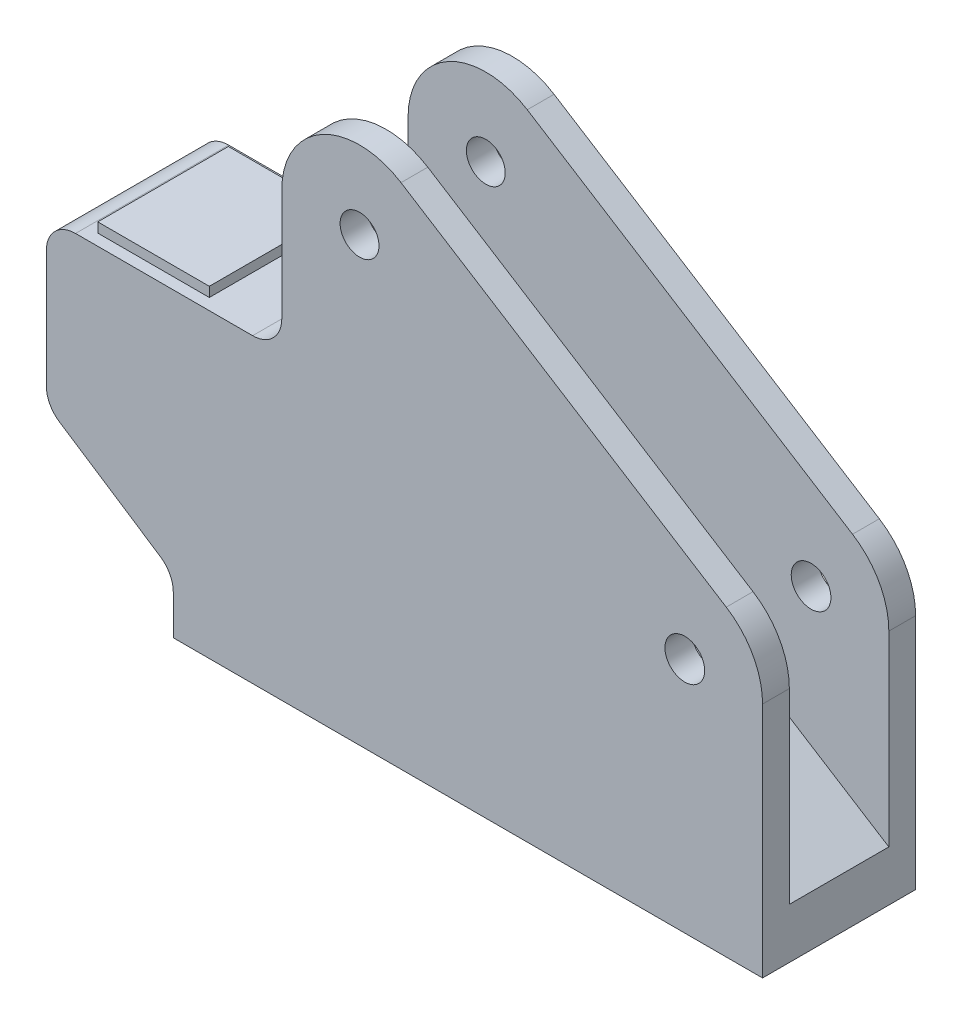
ISO-10303-21;
HEADER;
FILE_DESCRIPTION(('STEP AP214'),'2;1');
FILE_NAME('part.step','',(''),(''),'','','');
FILE_SCHEMA(('AUTOMOTIVE_DESIGN { 1 0 10303 214 1 1 1 1 }'));
ENDSEC;
DATA;
#1=APPLICATION_CONTEXT('core data for automotive mechanical design processes');
#2=APPLICATION_PROTOCOL_DEFINITION('international standard','automotive_design',2000,#1);
#3=PRODUCT_CONTEXT('',#1,'mechanical');
#4=PRODUCT('Part','Part','',(#3));
#5=PRODUCT_RELATED_PRODUCT_CATEGORY('part','',(#4));
#6=PRODUCT_DEFINITION_FORMATION('','',#4);
#7=PRODUCT_DEFINITION_CONTEXT('part definition',#1,'design');
#8=PRODUCT_DEFINITION('design','',#6,#7);
#9=PRODUCT_DEFINITION_SHAPE('','',#8);
#10=(LENGTH_UNIT() NAMED_UNIT(*) SI_UNIT(.MILLI.,.METRE.));
#11=(NAMED_UNIT(*) PLANE_ANGLE_UNIT() SI_UNIT($,.RADIAN.));
#12=(NAMED_UNIT(*) SI_UNIT($,.STERADIAN.) SOLID_ANGLE_UNIT());
#13=UNCERTAINTY_MEASURE_WITH_UNIT(LENGTH_MEASURE(1.E-05),#10,'distance_accuracy_value','');
#14=(GEOMETRIC_REPRESENTATION_CONTEXT(3) GLOBAL_UNCERTAINTY_ASSIGNED_CONTEXT((#13)) GLOBAL_UNIT_ASSIGNED_CONTEXT((#10,
#11,#12)) REPRESENTATION_CONTEXT('',''));
#15=CARTESIAN_POINT('',(0.,0.,0.));
#16=DIRECTION('',(0.,0.,1.));
#17=DIRECTION('',(1.,0.,0.));
#18=AXIS2_PLACEMENT_3D('',#15,#16,#17);
#19=CARTESIAN_POINT('',(207.4,787.4,400.));
#20=DIRECTION('',(0.,-1.,0.));
#21=DIRECTION('',(1.,0.,0.));
#22=AXIS2_PLACEMENT_3D('',#19,#20,#21);
#23=PLANE('',#22);
#24=DIRECTION('',(-1.,0.,0.));
#25=VECTOR('',#24,1.);
#26=CARTESIAN_POINT('',(207.4,787.4,0.));
#27=LINE('',#26,#25);
#28=CARTESIAN_POINT('',(207.4,787.4,0.));
#29=VERTEX_POINT('',#28);
#30=CARTESIAN_POINT('',(-255.38348006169,787.4,0.));
#31=VERTEX_POINT('',#30);
#32=EDGE_CURVE('E325',#29,#31,#27,.T.);
#33=ORIENTED_EDGE('',*,*,#32,.T.);
#34=DIRECTION('',(0.,0.,-1.));
#35=VECTOR('',#34,1.);
#36=CARTESIAN_POINT('',(-255.38348006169,787.4,400.));
#37=LINE('',#36,#35);
#38=CARTESIAN_POINT('',(-255.38348006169,787.4,400.));
#39=VERTEX_POINT('',#38);
#40=EDGE_CURVE('E350',#39,#31,#37,.T.);
#41=ORIENTED_EDGE('',*,*,#40,.F.);
#42=DIRECTION('',(-1.,0.,0.));
#43=VECTOR('',#42,1.);
#44=CARTESIAN_POINT('',(207.4,787.4,400.));
#45=LINE('',#44,#43);
#46=CARTESIAN_POINT('',(207.4,787.4,400.));
#47=VERTEX_POINT('',#46);
#48=EDGE_CURVE('E292',#47,#39,#45,.T.);
#49=ORIENTED_EDGE('',*,*,#48,.F.);
#50=DIRECTION('',(0.,0.,-1.));
#51=VECTOR('',#50,1.);
#52=CARTESIAN_POINT('',(207.4,787.4,400.));
#53=LINE('',#52,#51);
#54=EDGE_CURVE('E353',#47,#29,#53,.T.);
#55=ORIENTED_EDGE('',*,*,#54,.T.);
#56=EDGE_LOOP('',(#33,#41,#49,#55));
#57=FACE_BOUND('',#56,.T.);
#58=DIRECTION('',(0.,0.,1.));
#59=VECTOR('',#58,1.);
#60=CARTESIAN_POINT('',(-227.086377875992,787.4,28.9117784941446));
#61=LINE('',#60,#59);
#62=CARTESIAN_POINT('',(-227.086377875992,787.4,28.9117784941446));
#63=VERTEX_POINT('',#62);
#64=CARTESIAN_POINT('',(-227.086377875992,787.4,370.164244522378));
#65=VERTEX_POINT('',#64);
#66=EDGE_CURVE('E212',#63,#65,#61,.T.);
#67=ORIENTED_EDGE('',*,*,#66,.F.);
#68=DIRECTION('',(-1.,0.,0.));
#69=VECTOR('',#68,1.);
#70=CARTESIAN_POINT('',(-227.086377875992,787.4,28.9117784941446));
#71=LINE('',#70,#69);
#72=CARTESIAN_POINT('',(64.4080050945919,787.4,28.9117784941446));
#73=VERTEX_POINT('',#72);
#74=EDGE_CURVE('E209',#73,#63,#71,.T.);
#75=ORIENTED_EDGE('',*,*,#74,.F.);
#76=DIRECTION('',(0.,0.,-1.));
#77=VECTOR('',#76,1.);
#78=CARTESIAN_POINT('',(64.4080050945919,787.4,28.9117784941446));
#79=LINE('',#78,#77);
#80=CARTESIAN_POINT('',(64.4080050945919,787.4,370.164244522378));
#81=VERTEX_POINT('',#80);
#82=EDGE_CURVE('E52',#81,#73,#79,.T.);
#83=ORIENTED_EDGE('',*,*,#82,.F.);
#84=DIRECTION('',(1.,0.,0.));
#85=VECTOR('',#84,1.);
#86=CARTESIAN_POINT('',(-227.086377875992,787.4,370.164244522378));
#87=LINE('',#86,#85);
#88=EDGE_CURVE('E47',#65,#81,#87,.T.);
#89=ORIENTED_EDGE('',*,*,#88,.F.);
#90=EDGE_LOOP('',(#67,#75,#83,#89));
#91=FACE_BOUND('',#90,.T.);
#92=ADVANCED_FACE('F32',(#57,#91),#23,.F.);
#93=CARTESIAN_POINT('',(1336.8,620.,400.));
#94=DIRECTION('',(0.,0.,-1.));
#95=DIRECTION('',(-1.,0.,0.));
#96=AXIS2_PLACEMENT_3D('',#93,#94,#95);
#97=CYLINDRICAL_SURFACE('',#96,203.2);
#98=DIRECTION('',(0.,0.,-1.));
#99=VECTOR('',#98,1.);
#100=CARTESIAN_POINT('',(1445.14220637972,791.907551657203,400.));
#101=LINE('',#100,#99);
#102=CARTESIAN_POINT('',(1445.14220637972,791.907551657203,70.));
#103=VERTEX_POINT('',#102);
#104=CARTESIAN_POINT('',(1445.14220637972,791.907551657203,0.));
#105=VERTEX_POINT('',#104);
#106=EDGE_CURVE('E367',#103,#105,#101,.T.);
#107=ORIENTED_EDGE('',*,*,#106,.F.);
#108=CARTESIAN_POINT('',(1336.8,620.,70.));
#109=DIRECTION('',(0.,0.,-1.));
#110=DIRECTION('',(-1.,0.,0.));
#111=AXIS2_PLACEMENT_3D('',#108,#109,#110);
#112=CIRCLE('',#111,203.2);
#113=CARTESIAN_POINT('',(1540.,620.,70.));
#114=VERTEX_POINT('',#113);
#115=EDGE_CURVE('E253',#103,#114,#112,.T.);
#116=ORIENTED_EDGE('',*,*,#115,.T.);
#117=DIRECTION('',(0.,0.,-1.));
#118=VECTOR('',#117,1.);
#119=CARTESIAN_POINT('',(1540.,620.,400.));
#120=LINE('',#119,#118);
#121=CARTESIAN_POINT('',(1540.,620.,0.));
#122=VERTEX_POINT('',#121);
#123=EDGE_CURVE('E371',#114,#122,#120,.T.);
#124=ORIENTED_EDGE('',*,*,#123,.T.);
#125=CARTESIAN_POINT('',(1336.8,620.,0.));
#126=DIRECTION('',(0.,0.,1.));
#127=DIRECTION('',(1.,0.,0.));
#128=AXIS2_PLACEMENT_3D('',#125,#126,#127);
#129=CIRCLE('',#128,203.2);
#130=EDGE_CURVE('E312',#122,#105,#129,.T.);
#131=ORIENTED_EDGE('',*,*,#130,.T.);
#132=EDGE_LOOP('',(#107,#116,#124,#131));
#133=FACE_BOUND('',#132,.T.);
#134=ADVANCED_FACE('F411',(#133),#97,.T.);
#135=CARTESIAN_POINT('',(1445.14220637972,791.907551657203,400.));
#136=DIRECTION('',(-0.533180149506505,-0.84600173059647,0.));
#137=DIRECTION('',(0.84600173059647,-0.533180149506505,0.));
#138=AXIS2_PLACEMENT_3D('',#135,#136,#137);
#139=PLANE('',#138);
#140=DIRECTION('',(0.,0.,-1.));
#141=VECTOR('',#140,1.);
#142=CARTESIAN_POINT('',(595.142206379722,1327.6075516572,400.));
#143=LINE('',#142,#141);
#144=CARTESIAN_POINT('',(595.142206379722,1327.6075516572,70.));
#145=VERTEX_POINT('',#144);
#146=CARTESIAN_POINT('',(595.142206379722,1327.6075516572,0.));
#147=VERTEX_POINT('',#146);
#148=EDGE_CURVE('E363',#145,#147,#143,.T.);
#149=ORIENTED_EDGE('',*,*,#148,.F.);
#150=DIRECTION('',(-0.846001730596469,0.533180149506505,0.));
#151=VECTOR('',#150,1.);
#152=CARTESIAN_POINT('',(224.268360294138,1561.34533912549,70.));
#153=LINE('',#152,#151);
#154=EDGE_CURVE('E215',#103,#145,#153,.T.);
#155=ORIENTED_EDGE('',*,*,#154,.F.);
#156=ORIENTED_EDGE('',*,*,#106,.T.);
#157=DIRECTION('',(-0.84600173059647,0.533180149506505,0.));
#158=VECTOR('',#157,1.);
#159=CARTESIAN_POINT('',(1445.14220637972,791.907551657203,0.));
#160=LINE('',#159,#158);
#161=EDGE_CURVE('E315',#105,#147,#160,.T.);
#162=ORIENTED_EDGE('',*,*,#161,.T.);
#163=EDGE_LOOP('',(#149,#155,#156,#162));
#164=FACE_BOUND('',#163,.T.);
#165=ADVANCED_FACE('F417',(#164),#139,.F.);
#166=CARTESIAN_POINT('',(486.8,1155.7,400.));
#167=DIRECTION('',(0.,0.,-1.));
#168=DIRECTION('',(-1.,0.,0.));
#169=AXIS2_PLACEMENT_3D('',#166,#167,#168);
#170=CYLINDRICAL_SURFACE('',#169,203.2);
#171=DIRECTION('',(0.,0.,-1.));
#172=VECTOR('',#171,1.);
#173=CARTESIAN_POINT('',(283.6,1155.7,400.));
#174=LINE('',#173,#172);
#175=CARTESIAN_POINT('',(283.6,1155.7,70.));
#176=VERTEX_POINT('',#175);
#177=CARTESIAN_POINT('',(283.6,1155.7,0.));
#178=VERTEX_POINT('',#177);
#179=EDGE_CURVE('E359',#176,#178,#174,.T.);
#180=ORIENTED_EDGE('',*,*,#179,.F.);
#181=CARTESIAN_POINT('',(486.8,1155.7,70.));
#182=DIRECTION('',(0.,0.,-1.));
#183=DIRECTION('',(-1.,0.,0.));
#184=AXIS2_PLACEMENT_3D('',#181,#182,#183);
#185=CIRCLE('',#184,203.2);
#186=EDGE_CURVE('E250',#176,#145,#185,.T.);
#187=ORIENTED_EDGE('',*,*,#186,.T.);
#188=ORIENTED_EDGE('',*,*,#148,.T.);
#189=CARTESIAN_POINT('',(486.8,1155.7,0.));
#190=DIRECTION('',(0.,0.,1.));
#191=DIRECTION('',(1.,0.,0.));
#192=AXIS2_PLACEMENT_3D('',#189,#190,#191);
#193=CIRCLE('',#192,203.2);
#194=EDGE_CURVE('E318',#147,#178,#193,.T.);
#195=ORIENTED_EDGE('',*,*,#194,.T.);
#196=EDGE_LOOP('',(#180,#187,#188,#195));
#197=FACE_BOUND('',#196,.T.);
#198=ADVANCED_FACE('F438',(#197),#170,.T.);
#199=CARTESIAN_POINT('',(486.8,1155.7,400.));
#200=DIRECTION('',(0.,0.,-1.));
#201=DIRECTION('',(-1.,0.,0.));
#202=AXIS2_PLACEMENT_3D('',#199,#200,#201);
#203=CYLINDRICAL_SURFACE('',#202,50.7999999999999);
#204=CARTESIAN_POINT('',(486.8,1155.7,70.));
#205=DIRECTION('',(0.,0.,-1.));
#206=DIRECTION('',(-1.,0.,0.));
#207=AXIS2_PLACEMENT_3D('',#204,#205,#206);
#208=CIRCLE('',#207,50.7999999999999);
#209=CARTESIAN_POINT('',(436.,1155.7,70.));
#210=VERTEX_POINT('',#209);
#211=EDGE_CURVE('E244',#210,#210,#208,.T.);
#212=ORIENTED_EDGE('',*,*,#211,.F.);
#213=EDGE_LOOP('',(#212));
#214=FACE_BOUND('',#213,.T.);
#215=CARTESIAN_POINT('',(486.8,1155.7,0.));
#216=DIRECTION('',(0.,0.,1.));
#217=DIRECTION('',(1.,0.,0.));
#218=AXIS2_PLACEMENT_3D('',#215,#216,#217);
#219=CIRCLE('',#218,50.7999999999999);
#220=CARTESIAN_POINT('',(537.6,1155.7,0.));
#221=VERTEX_POINT('',#220);
#222=EDGE_CURVE('E265',#221,#221,#219,.T.);
#223=ORIENTED_EDGE('',*,*,#222,.F.);
#224=EDGE_LOOP('',(#223));
#225=FACE_BOUND('',#224,.T.);
#226=ADVANCED_FACE('F391',(#214,#225),#203,.F.);
#227=CARTESIAN_POINT('',(1336.8,620.,400.));
#228=DIRECTION('',(0.,0.,-1.));
#229=DIRECTION('',(-1.,0.,0.));
#230=AXIS2_PLACEMENT_3D('',#227,#228,#229);
#231=CYLINDRICAL_SURFACE('',#230,51.9020150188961);
#232=CARTESIAN_POINT('',(1336.8,620.,70.));
#233=DIRECTION('',(0.,0.,-1.));
#234=DIRECTION('',(-1.,0.,0.));
#235=AXIS2_PLACEMENT_3D('',#232,#233,#234);
#236=CIRCLE('',#235,51.9020150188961);
#237=CARTESIAN_POINT('',(1284.8979849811,620.,70.));
#238=VERTEX_POINT('',#237);
#239=EDGE_CURVE('E243',#238,#238,#236,.T.);
#240=ORIENTED_EDGE('',*,*,#239,.F.);
#241=EDGE_LOOP('',(#240));
#242=FACE_BOUND('',#241,.T.);
#243=CARTESIAN_POINT('',(1336.8,620.,0.));
#244=DIRECTION('',(0.,0.,1.));
#245=DIRECTION('',(1.,0.,0.));
#246=AXIS2_PLACEMENT_3D('',#243,#244,#245);
#247=CIRCLE('',#246,51.9020150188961);
#248=CARTESIAN_POINT('',(1388.7020150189,620.,0.));
#249=VERTEX_POINT('',#248);
#250=EDGE_CURVE('E261',#249,#249,#247,.T.);
#251=ORIENTED_EDGE('',*,*,#250,.F.);
#252=EDGE_LOOP('',(#251));
#253=FACE_BOUND('',#252,.T.);
#254=ADVANCED_FACE('F387',(#242,#253),#231,.F.);
#255=CARTESIAN_POINT('',(1336.8,620.,400.));
#256=DIRECTION('',(0.,0.,1.));
#257=DIRECTION('',(1.,0.,0.));
#258=AXIS2_PLACEMENT_3D('',#255,#256,#257);
#259=PLANE('',#258);
#260=CARTESIAN_POINT('',(486.8,1155.7,400.));
#261=DIRECTION('',(0.,0.,1.));
#262=DIRECTION('',(1.,0.,0.));
#263=AXIS2_PLACEMENT_3D('',#260,#261,#262);
#264=CIRCLE('',#263,50.7999999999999);
#265=CARTESIAN_POINT('',(537.6,1155.7,400.));
#266=VERTEX_POINT('',#265);
#267=EDGE_CURVE('E268',#266,#266,#264,.T.);
#268=ORIENTED_EDGE('',*,*,#267,.F.);
#269=EDGE_LOOP('',(#268));
#270=FACE_BOUND('',#269,.T.);
#271=DIRECTION('',(0.,-1.,0.));
#272=VECTOR('',#271,1.);
#273=CARTESIAN_POINT('',(0.,103.627690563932,400.));
#274=LINE('',#273,#272);
#275=CARTESIAN_POINT('',(0.,103.627690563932,400.));
#276=VERTEX_POINT('',#275);
#277=CARTESIAN_POINT('',(0.,0.,400.));
#278=VERTEX_POINT('',#277);
#279=EDGE_CURVE('E274',#276,#278,#274,.T.);
#280=ORIENTED_EDGE('',*,*,#279,.T.);
#281=DIRECTION('',(1.,0.,0.));
#282=VECTOR('',#281,1.);
#283=CARTESIAN_POINT('',(0.,0.,400.));
#284=LINE('',#283,#282);
#285=CARTESIAN_POINT('',(1540.,0.,400.));
#286=VERTEX_POINT('',#285);
#287=EDGE_CURVE('E277',#278,#286,#284,.T.);
#288=ORIENTED_EDGE('',*,*,#287,.T.);
#289=DIRECTION('',(0.,1.,0.));
#290=VECTOR('',#289,1.);
#291=CARTESIAN_POINT('',(1540.,0.,400.));
#292=LINE('',#291,#290);
#293=CARTESIAN_POINT('',(1540.,620.,400.));
#294=VERTEX_POINT('',#293);
#295=EDGE_CURVE('E280',#286,#294,#292,.T.);
#296=ORIENTED_EDGE('',*,*,#295,.T.);
#297=CARTESIAN_POINT('',(1336.8,620.,400.));
#298=DIRECTION('',(0.,0.,1.));
#299=DIRECTION('',(1.,0.,0.));
#300=AXIS2_PLACEMENT_3D('',#297,#298,#299);
#301=CIRCLE('',#300,203.2);
#302=CARTESIAN_POINT('',(1445.14220637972,791.907551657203,400.));
#303=VERTEX_POINT('',#302);
#304=EDGE_CURVE('E282',#294,#303,#301,.T.);
#305=ORIENTED_EDGE('',*,*,#304,.T.);
#306=DIRECTION('',(-0.84600173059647,0.533180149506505,0.));
#307=VECTOR('',#306,1.);
#308=CARTESIAN_POINT('',(1445.14220637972,791.907551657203,400.));
#309=LINE('',#308,#307);
#310=CARTESIAN_POINT('',(595.142206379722,1327.6075516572,400.));
#311=VERTEX_POINT('',#310);
#312=EDGE_CURVE('E284',#303,#311,#309,.T.);
#313=ORIENTED_EDGE('',*,*,#312,.T.);
#314=CARTESIAN_POINT('',(486.8,1155.7,400.));
#315=DIRECTION('',(0.,0.,1.));
#316=DIRECTION('',(1.,0.,0.));
#317=AXIS2_PLACEMENT_3D('',#314,#315,#316);
#318=CIRCLE('',#317,203.2);
#319=CARTESIAN_POINT('',(283.6,1155.7,400.));
#320=VERTEX_POINT('',#319);
#321=EDGE_CURVE('E286',#311,#320,#318,.T.);
#322=ORIENTED_EDGE('',*,*,#321,.T.);
#323=DIRECTION('',(0.,-1.,0.));
#324=VECTOR('',#323,1.);
#325=CARTESIAN_POINT('',(283.6,1155.7,400.));
#326=LINE('',#325,#324);
#327=CARTESIAN_POINT('',(283.6,863.6,400.));
#328=VERTEX_POINT('',#327);
#329=EDGE_CURVE('E288',#320,#328,#326,.T.);
#330=ORIENTED_EDGE('',*,*,#329,.T.);
#331=CARTESIAN_POINT('',(207.4,863.6,400.));
#332=DIRECTION('',(0.,0.,-1.));
#333=DIRECTION('',(-1.,0.,0.));
#334=AXIS2_PLACEMENT_3D('',#331,#332,#333);
#335=CIRCLE('',#334,76.2);
#336=EDGE_CURVE('E290',#328,#47,#335,.T.);
#337=ORIENTED_EDGE('',*,*,#336,.T.);
#338=ORIENTED_EDGE('',*,*,#48,.T.);
#339=CARTESIAN_POINT('',(-255.38348006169,711.2,400.));
#340=DIRECTION('',(0.,0.,1.));
#341=DIRECTION('',(1.,0.,0.));
#342=AXIS2_PLACEMENT_3D('',#339,#340,#341);
#343=CIRCLE('',#342,76.2000000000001);
#344=CARTESIAN_POINT('',(-331.58348006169,711.2,400.));
#345=VERTEX_POINT('',#344);
#346=EDGE_CURVE('E294',#39,#345,#343,.T.);
#347=ORIENTED_EDGE('',*,*,#346,.T.);
#348=DIRECTION('',(0.,-1.,0.));
#349=VECTOR('',#348,1.);
#350=CARTESIAN_POINT('',(-331.58348006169,711.2,400.));
#351=LINE('',#350,#349);
#352=CARTESIAN_POINT('',(-331.58348006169,403.289464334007,400.));
#353=VERTEX_POINT('',#352);
#354=EDGE_CURVE('E296',#345,#353,#351,.T.);
#355=ORIENTED_EDGE('',*,*,#354,.T.);
#356=CARTESIAN_POINT('',(-255.38348006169,403.289464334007,400.));
#357=DIRECTION('',(0.,0.,1.));
#358=DIRECTION('',(1.,0.,0.));
#359=AXIS2_PLACEMENT_3D('',#356,#357,#358);
#360=CIRCLE('',#359,76.2);
#361=CARTESIAN_POINT('',(-297.154884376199,339.558861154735,400.));
#362=VERTEX_POINT('',#361);
#363=EDGE_CURVE('E298',#353,#362,#360,.T.);
#364=ORIENTED_EDGE('',*,*,#363,.T.);
#365=DIRECTION('',(0.836359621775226,-0.54818115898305,0.));
#366=VECTOR('',#365,1.);
#367=CARTESIAN_POINT('',(-297.154884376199,339.558861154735,400.));
#368=LINE('',#367,#366);
#369=CARTESIAN_POINT('',(-34.4285956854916,167.358293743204,400.));
#370=VERTEX_POINT('',#369);
#371=EDGE_CURVE('E300',#362,#370,#368,.T.);
#372=ORIENTED_EDGE('',*,*,#371,.T.);
#373=CARTESIAN_POINT('',(-76.2,103.627690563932,400.));
#374=DIRECTION('',(0.,0.,-1.));
#375=DIRECTION('',(-1.,0.,0.));
#376=AXIS2_PLACEMENT_3D('',#373,#374,#375);
#377=CIRCLE('',#376,76.2);
#378=EDGE_CURVE('E302',#370,#276,#377,.T.);
#379=ORIENTED_EDGE('',*,*,#378,.T.);
#380=EDGE_LOOP('',(#280,#288,#296,#305,#313,#322,#330,#337,#338,#347,#355,#364,#372,#379));
#381=FACE_BOUND('',#380,.T.);
#382=CARTESIAN_POINT('',(1336.8,620.,400.));
#383=DIRECTION('',(0.,0.,1.));
#384=DIRECTION('',(1.,0.,0.));
#385=AXIS2_PLACEMENT_3D('',#382,#383,#384);
#386=CIRCLE('',#385,51.9020150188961);
#387=CARTESIAN_POINT('',(1388.7020150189,620.,400.));
#388=VERTEX_POINT('',#387);
#389=EDGE_CURVE('E262',#388,#388,#386,.T.);
#390=ORIENTED_EDGE('',*,*,#389,.F.);
#391=EDGE_LOOP('',(#390));
#392=FACE_BOUND('',#391,.T.);
#393=ADVANCED_FACE('F390',(#270,#381,#392),#259,.T.);
#394=CARTESIAN_POINT('',(1336.8,620.,0.));
#395=DIRECTION('',(0.,0.,1.));
#396=DIRECTION('',(1.,0.,0.));
#397=AXIS2_PLACEMENT_3D('',#394,#395,#396);
#398=PLANE('',#397);
#399=ORIENTED_EDGE('',*,*,#222,.T.);
#400=EDGE_LOOP('',(#399));
#401=FACE_BOUND('',#400,.T.);
#402=DIRECTION('',(0.,-1.,0.));
#403=VECTOR('',#402,1.);
#404=CARTESIAN_POINT('',(0.,103.627690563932,0.));
#405=LINE('',#404,#403);
#406=CARTESIAN_POINT('',(0.,103.627690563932,0.));
#407=VERTEX_POINT('',#406);
#408=CARTESIAN_POINT('',(0.,0.,0.));
#409=VERTEX_POINT('',#408);
#410=EDGE_CURVE('E271',#407,#409,#405,.T.);
#411=ORIENTED_EDGE('',*,*,#410,.F.);
#412=CARTESIAN_POINT('',(-76.2,103.627690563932,0.));
#413=DIRECTION('',(0.,0.,-1.));
#414=DIRECTION('',(-1.,0.,0.));
#415=AXIS2_PLACEMENT_3D('',#412,#413,#414);
#416=CIRCLE('',#415,76.2);
#417=CARTESIAN_POINT('',(-34.4285956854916,167.358293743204,0.));
#418=VERTEX_POINT('',#417);
#419=EDGE_CURVE('E278',#418,#407,#416,.T.);
#420=ORIENTED_EDGE('',*,*,#419,.F.);
#421=DIRECTION('',(0.836359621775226,-0.54818115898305,0.));
#422=VECTOR('',#421,1.);
#423=CARTESIAN_POINT('',(-297.154884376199,339.558861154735,0.));
#424=LINE('',#423,#422);
#425=CARTESIAN_POINT('',(-297.154884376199,339.558861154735,0.));
#426=VERTEX_POINT('',#425);
#427=EDGE_CURVE('E333',#426,#418,#424,.T.);
#428=ORIENTED_EDGE('',*,*,#427,.F.);
#429=CARTESIAN_POINT('',(-255.38348006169,403.289464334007,0.));
#430=DIRECTION('',(0.,0.,1.));
#431=DIRECTION('',(1.,0.,0.));
#432=AXIS2_PLACEMENT_3D('',#429,#430,#431);
#433=CIRCLE('',#432,76.2);
#434=CARTESIAN_POINT('',(-331.58348006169,403.289464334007,0.));
#435=VERTEX_POINT('',#434);
#436=EDGE_CURVE('E331',#435,#426,#433,.T.);
#437=ORIENTED_EDGE('',*,*,#436,.F.);
#438=DIRECTION('',(0.,-1.,0.));
#439=VECTOR('',#438,1.);
#440=CARTESIAN_POINT('',(-331.58348006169,711.2,0.));
#441=LINE('',#440,#439);
#442=CARTESIAN_POINT('',(-331.58348006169,711.2,0.));
#443=VERTEX_POINT('',#442);
#444=EDGE_CURVE('E329',#443,#435,#441,.T.);
#445=ORIENTED_EDGE('',*,*,#444,.F.);
#446=CARTESIAN_POINT('',(-255.38348006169,711.2,0.));
#447=DIRECTION('',(0.,0.,1.));
#448=DIRECTION('',(1.,0.,0.));
#449=AXIS2_PLACEMENT_3D('',#446,#447,#448);
#450=CIRCLE('',#449,76.2000000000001);
#451=EDGE_CURVE('E327',#31,#443,#450,.T.);
#452=ORIENTED_EDGE('',*,*,#451,.F.);
#453=ORIENTED_EDGE('',*,*,#32,.F.);
#454=CARTESIAN_POINT('',(207.4,863.6,0.));
#455=DIRECTION('',(0.,0.,-1.));
#456=DIRECTION('',(-1.,0.,0.));
#457=AXIS2_PLACEMENT_3D('',#454,#455,#456);
#458=CIRCLE('',#457,76.2);
#459=CARTESIAN_POINT('',(283.6,863.6,0.));
#460=VERTEX_POINT('',#459);
#461=EDGE_CURVE('E323',#460,#29,#458,.T.);
#462=ORIENTED_EDGE('',*,*,#461,.F.);
#463=DIRECTION('',(0.,-1.,0.));
#464=VECTOR('',#463,1.);
#465=CARTESIAN_POINT('',(283.6,1155.7,0.));
#466=LINE('',#465,#464);
#467=EDGE_CURVE('E321',#178,#460,#466,.T.);
#468=ORIENTED_EDGE('',*,*,#467,.F.);
#469=ORIENTED_EDGE('',*,*,#194,.F.);
#470=ORIENTED_EDGE('',*,*,#161,.F.);
#471=ORIENTED_EDGE('',*,*,#130,.F.);
#472=DIRECTION('',(0.,1.,0.));
#473=VECTOR('',#472,1.);
#474=CARTESIAN_POINT('',(1540.,0.,0.));
#475=LINE('',#474,#473);
#476=CARTESIAN_POINT('',(1540.,0.,0.));
#477=VERTEX_POINT('',#476);
#478=EDGE_CURVE('E309',#477,#122,#475,.T.);
#479=ORIENTED_EDGE('',*,*,#478,.F.);
#480=DIRECTION('',(1.,0.,0.));
#481=VECTOR('',#480,1.);
#482=CARTESIAN_POINT('',(0.,0.,0.));
#483=LINE('',#482,#481);
#484=EDGE_CURVE('E307',#409,#477,#483,.T.);
#485=ORIENTED_EDGE('',*,*,#484,.F.);
#486=EDGE_LOOP('',(#411,#420,#428,#437,#445,#452,#453,#462,#468,#469,#470,#471,#479,#485));
#487=FACE_BOUND('',#486,.T.);
#488=ORIENTED_EDGE('',*,*,#250,.T.);
#489=EDGE_LOOP('',(#488));
#490=FACE_BOUND('',#489,.T.);
#491=ADVANCED_FACE('F396',(#401,#487,#490),#398,.F.);
#492=CARTESIAN_POINT('',(0.,103.627690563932,400.));
#493=DIRECTION('',(1.,0.,0.));
#494=DIRECTION('',(0.,0.,-1.));
#495=AXIS2_PLACEMENT_3D('',#492,#493,#494);
#496=PLANE('',#495);
#497=ORIENTED_EDGE('',*,*,#410,.T.);
#498=DIRECTION('',(0.,0.,-1.));
#499=VECTOR('',#498,1.);
#500=CARTESIAN_POINT('',(0.,0.,400.));
#501=LINE('',#500,#499);
#502=EDGE_CURVE('E40',#278,#409,#501,.T.);
#503=ORIENTED_EDGE('',*,*,#502,.F.);
#504=ORIENTED_EDGE('',*,*,#279,.F.);
#505=DIRECTION('',(0.,0.,-1.));
#506=VECTOR('',#505,1.);
#507=CARTESIAN_POINT('',(0.,103.627690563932,400.));
#508=LINE('',#507,#506);
#509=EDGE_CURVE('E304',#276,#407,#508,.T.);
#510=ORIENTED_EDGE('',*,*,#509,.T.);
#511=EDGE_LOOP('',(#497,#503,#504,#510));
#512=FACE_BOUND('',#511,.T.);
#513=ADVANCED_FACE('F34',(#512),#496,.F.);
#514=CARTESIAN_POINT('',(0.,0.,400.));
#515=DIRECTION('',(0.,1.,0.));
#516=DIRECTION('',(0.,0.,1.));
#517=AXIS2_PLACEMENT_3D('',#514,#515,#516);
#518=PLANE('',#517);
#519=ORIENTED_EDGE('',*,*,#484,.T.);
#520=DIRECTION('',(0.,0.,-1.));
#521=VECTOR('',#520,1.);
#522=CARTESIAN_POINT('',(1540.,0.,400.));
#523=LINE('',#522,#521);
#524=EDGE_CURVE('E375',#286,#477,#523,.T.);
#525=ORIENTED_EDGE('',*,*,#524,.F.);
#526=ORIENTED_EDGE('',*,*,#287,.F.);
#527=ORIENTED_EDGE('',*,*,#502,.T.);
#528=EDGE_LOOP('',(#519,#525,#526,#527));
#529=FACE_BOUND('',#528,.T.);
#530=ADVANCED_FACE('F404',(#529),#518,.F.);
#531=CARTESIAN_POINT('',(1540.,0.,400.));
#532=DIRECTION('',(-1.,0.,0.));
#533=DIRECTION('',(0.,0.,1.));
#534=AXIS2_PLACEMENT_3D('',#531,#532,#533);
#535=PLANE('',#534);
#536=ORIENTED_EDGE('',*,*,#123,.F.);
#537=DIRECTION('',(0.,-1.,0.));
#538=VECTOR('',#537,1.);
#539=CARTESIAN_POINT('',(1540.,0.,70.));
#540=LINE('',#539,#538);
#541=CARTESIAN_POINT('',(1540.,131.653237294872,70.));
#542=VERTEX_POINT('',#541);
#543=EDGE_CURVE('E256',#114,#542,#540,.T.);
#544=ORIENTED_EDGE('',*,*,#543,.T.);
#545=DIRECTION('',(0.,0.,-1.));
#546=VECTOR('',#545,1.);
#547=CARTESIAN_POINT('',(1540.,131.653237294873,400.));
#548=LINE('',#547,#546);
#549=CARTESIAN_POINT('',(1540.,131.653237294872,330.));
#550=VERTEX_POINT('',#549);
#551=EDGE_CURVE('E259',#550,#542,#548,.T.);
#552=ORIENTED_EDGE('',*,*,#551,.F.);
#553=DIRECTION('',(0.,1.,0.));
#554=VECTOR('',#553,1.);
#555=CARTESIAN_POINT('',(1540.,0.,330.));
#556=LINE('',#555,#554);
#557=CARTESIAN_POINT('',(1540.,620.,330.));
#558=VERTEX_POINT('',#557);
#559=EDGE_CURVE('E240',#550,#558,#556,.T.);
#560=ORIENTED_EDGE('',*,*,#559,.T.);
#561=EDGE_CURVE('E372',#294,#558,#120,.T.);
#562=ORIENTED_EDGE('',*,*,#561,.F.);
#563=ORIENTED_EDGE('',*,*,#295,.F.);
#564=ORIENTED_EDGE('',*,*,#524,.T.);
#565=ORIENTED_EDGE('',*,*,#478,.T.);
#566=EDGE_LOOP('',(#536,#544,#552,#560,#562,#563,#564,#565));
#567=FACE_BOUND('',#566,.T.);
#568=ADVANCED_FACE('F443',(#567),#535,.F.);
#569=ORIENTED_EDGE('',*,*,#561,.T.);
#570=CARTESIAN_POINT('',(1336.8,620.,330.));
#571=DIRECTION('',(0.,0.,1.));
#572=DIRECTION('',(1.,0.,0.));
#573=AXIS2_PLACEMENT_3D('',#570,#571,#572);
#574=CIRCLE('',#573,203.2);
#575=CARTESIAN_POINT('',(1445.14220637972,791.907551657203,330.));
#576=VERTEX_POINT('',#575);
#577=EDGE_CURVE('E237',#558,#576,#574,.T.);
#578=ORIENTED_EDGE('',*,*,#577,.T.);
#579=EDGE_CURVE('E368',#303,#576,#101,.T.);
#580=ORIENTED_EDGE('',*,*,#579,.F.);
#581=ORIENTED_EDGE('',*,*,#304,.F.);
#582=EDGE_LOOP('',(#569,#578,#580,#581));
#583=FACE_BOUND('',#582,.T.);
#584=ADVANCED_FACE('F420',(#583),#97,.T.);
#585=ORIENTED_EDGE('',*,*,#579,.T.);
#586=DIRECTION('',(0.846001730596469,-0.533180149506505,0.));
#587=VECTOR('',#586,1.);
#588=CARTESIAN_POINT('',(224.268360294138,1561.34533912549,330.));
#589=LINE('',#588,#587);
#590=CARTESIAN_POINT('',(595.142206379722,1327.6075516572,330.));
#591=VERTEX_POINT('',#590);
#592=EDGE_CURVE('E213',#591,#576,#589,.T.);
#593=ORIENTED_EDGE('',*,*,#592,.F.);
#594=EDGE_CURVE('E364',#311,#591,#143,.T.);
#595=ORIENTED_EDGE('',*,*,#594,.F.);
#596=ORIENTED_EDGE('',*,*,#312,.F.);
#597=EDGE_LOOP('',(#585,#593,#595,#596));
#598=FACE_BOUND('',#597,.T.);
#599=ADVANCED_FACE('F436',(#598),#139,.F.);
#600=ORIENTED_EDGE('',*,*,#594,.T.);
#601=CARTESIAN_POINT('',(486.8,1155.7,330.));
#602=DIRECTION('',(0.,0.,1.));
#603=DIRECTION('',(1.,0.,0.));
#604=AXIS2_PLACEMENT_3D('',#601,#602,#603);
#605=CIRCLE('',#604,203.2);
#606=CARTESIAN_POINT('',(283.6,1155.7,330.));
#607=VERTEX_POINT('',#606);
#608=EDGE_CURVE('E234',#591,#607,#605,.T.);
#609=ORIENTED_EDGE('',*,*,#608,.T.);
#610=EDGE_CURVE('E360',#320,#607,#174,.T.);
#611=ORIENTED_EDGE('',*,*,#610,.F.);
#612=ORIENTED_EDGE('',*,*,#321,.F.);
#613=EDGE_LOOP('',(#600,#609,#611,#612));
#614=FACE_BOUND('',#613,.T.);
#615=ADVANCED_FACE('F432',(#614),#170,.T.);
#616=CARTESIAN_POINT('',(283.6,1155.7,400.));
#617=DIRECTION('',(1.,0.,0.));
#618=DIRECTION('',(0.,1.,0.));
#619=AXIS2_PLACEMENT_3D('',#616,#617,#618);
#620=PLANE('',#619);
#621=DIRECTION('',(0.,0.,1.));
#622=VECTOR('',#621,1.);
#623=CARTESIAN_POINT('',(283.6,923.480860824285,400.));
#624=LINE('',#623,#622);
#625=CARTESIAN_POINT('',(283.6,923.480860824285,70.));
#626=VERTEX_POINT('',#625);
#627=CARTESIAN_POINT('',(283.6,923.480860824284,330.));
#628=VERTEX_POINT('',#627);
#629=EDGE_CURVE('E11',#626,#628,#624,.T.);
#630=ORIENTED_EDGE('',*,*,#629,.F.);
#631=DIRECTION('',(0.,1.,0.));
#632=VECTOR('',#631,1.);
#633=CARTESIAN_POINT('',(283.6,1155.7,70.));
#634=LINE('',#633,#632);
#635=EDGE_CURVE('E247',#626,#176,#634,.T.);
#636=ORIENTED_EDGE('',*,*,#635,.T.);
#637=ORIENTED_EDGE('',*,*,#179,.T.);
#638=ORIENTED_EDGE('',*,*,#467,.T.);
#639=DIRECTION('',(0.,0.,-1.));
#640=VECTOR('',#639,1.);
#641=CARTESIAN_POINT('',(283.6,863.6,400.));
#642=LINE('',#641,#640);
#643=EDGE_CURVE('E356',#328,#460,#642,.T.);
#644=ORIENTED_EDGE('',*,*,#643,.F.);
#645=ORIENTED_EDGE('',*,*,#329,.F.);
#646=ORIENTED_EDGE('',*,*,#610,.T.);
#647=DIRECTION('',(0.,-1.,0.));
#648=VECTOR('',#647,1.);
#649=CARTESIAN_POINT('',(283.6,1155.7,330.));
#650=LINE('',#649,#648);
#651=EDGE_CURVE('E231',#607,#628,#650,.T.);
#652=ORIENTED_EDGE('',*,*,#651,.T.);
#653=EDGE_LOOP('',(#630,#636,#637,#638,#644,#645,#646,#652));
#654=FACE_BOUND('',#653,.T.);
#655=ADVANCED_FACE('F428',(#654),#620,.F.);
#656=CARTESIAN_POINT('',(207.4,863.6,400.));
#657=DIRECTION('',(0.,0.,-1.));
#658=DIRECTION('',(-1.,0.,0.));
#659=AXIS2_PLACEMENT_3D('',#656,#657,#658);
#660=CYLINDRICAL_SURFACE('',#659,76.2);
#661=ORIENTED_EDGE('',*,*,#461,.T.);
#662=ORIENTED_EDGE('',*,*,#54,.F.);
#663=ORIENTED_EDGE('',*,*,#336,.F.);
#664=ORIENTED_EDGE('',*,*,#643,.T.);
#665=EDGE_LOOP('',(#661,#662,#663,#664));
#666=FACE_BOUND('',#665,.T.);
#667=ADVANCED_FACE('F425',(#666),#660,.F.);
#668=CARTESIAN_POINT('',(-255.38348006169,711.2,400.));
#669=DIRECTION('',(0.,0.,-1.));
#670=DIRECTION('',(-1.,0.,0.));
#671=AXIS2_PLACEMENT_3D('',#668,#669,#670);
#672=CYLINDRICAL_SURFACE('',#671,76.2000000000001);
#673=ORIENTED_EDGE('',*,*,#451,.T.);
#674=DIRECTION('',(0.,0.,-1.));
#675=VECTOR('',#674,1.);
#676=CARTESIAN_POINT('',(-331.58348006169,711.2,400.));
#677=LINE('',#676,#675);
#678=EDGE_CURVE('E347',#345,#443,#677,.T.);
#679=ORIENTED_EDGE('',*,*,#678,.F.);
#680=ORIENTED_EDGE('',*,*,#346,.F.);
#681=ORIENTED_EDGE('',*,*,#40,.T.);
#682=EDGE_LOOP('',(#673,#679,#680,#681));
#683=FACE_BOUND('',#682,.T.);
#684=ADVANCED_FACE('F423',(#683),#672,.T.);
#685=CARTESIAN_POINT('',(-331.58348006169,711.2,400.));
#686=DIRECTION('',(1.,0.,0.));
#687=DIRECTION('',(0.,0.,-1.));
#688=AXIS2_PLACEMENT_3D('',#685,#686,#687);
#689=PLANE('',#688);
#690=ORIENTED_EDGE('',*,*,#444,.T.);
#691=DIRECTION('',(0.,0.,-1.));
#692=VECTOR('',#691,1.);
#693=CARTESIAN_POINT('',(-331.58348006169,403.289464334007,400.));
#694=LINE('',#693,#692);
#695=EDGE_CURVE('E344',#353,#435,#694,.T.);
#696=ORIENTED_EDGE('',*,*,#695,.F.);
#697=ORIENTED_EDGE('',*,*,#354,.F.);
#698=ORIENTED_EDGE('',*,*,#678,.T.);
#699=EDGE_LOOP('',(#690,#696,#697,#698));
#700=FACE_BOUND('',#699,.T.);
#701=ADVANCED_FACE('F504',(#700),#689,.F.);
#702=CARTESIAN_POINT('',(-255.38348006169,403.289464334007,400.));
#703=DIRECTION('',(0.,0.,-1.));
#704=DIRECTION('',(-1.,0.,0.));
#705=AXIS2_PLACEMENT_3D('',#702,#703,#704);
#706=CYLINDRICAL_SURFACE('',#705,76.2);
#707=ORIENTED_EDGE('',*,*,#436,.T.);
#708=DIRECTION('',(0.,0.,-1.));
#709=VECTOR('',#708,1.);
#710=CARTESIAN_POINT('',(-297.154884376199,339.558861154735,400.));
#711=LINE('',#710,#709);
#712=EDGE_CURVE('E341',#362,#426,#711,.T.);
#713=ORIENTED_EDGE('',*,*,#712,.F.);
#714=ORIENTED_EDGE('',*,*,#363,.F.);
#715=ORIENTED_EDGE('',*,*,#695,.T.);
#716=EDGE_LOOP('',(#707,#713,#714,#715));
#717=FACE_BOUND('',#716,.T.);
#718=ADVANCED_FACE('F498',(#717),#706,.T.);
#719=CARTESIAN_POINT('',(-297.154884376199,339.558861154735,400.));
#720=DIRECTION('',(0.54818115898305,0.836359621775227,0.));
#721=DIRECTION('',(-0.836359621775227,0.54818115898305,0.));
#722=AXIS2_PLACEMENT_3D('',#719,#720,#721);
#723=PLANE('',#722);
#724=ORIENTED_EDGE('',*,*,#427,.T.);
#725=DIRECTION('',(0.,0.,-1.));
#726=VECTOR('',#725,1.);
#727=CARTESIAN_POINT('',(-34.4285956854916,167.358293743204,400.));
#728=LINE('',#727,#726);
#729=EDGE_CURVE('E338',#370,#418,#728,.T.);
#730=ORIENTED_EDGE('',*,*,#729,.F.);
#731=ORIENTED_EDGE('',*,*,#371,.F.);
#732=ORIENTED_EDGE('',*,*,#712,.T.);
#733=EDGE_LOOP('',(#724,#730,#731,#732));
#734=FACE_BOUND('',#733,.T.);
#735=ADVANCED_FACE('F494',(#734),#723,.F.);
#736=CARTESIAN_POINT('',(-76.2,103.627690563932,400.));
#737=DIRECTION('',(0.,0.,-1.));
#738=DIRECTION('',(-1.,0.,0.));
#739=AXIS2_PLACEMENT_3D('',#736,#737,#738);
#740=CYLINDRICAL_SURFACE('',#739,76.2);
#741=ORIENTED_EDGE('',*,*,#419,.T.);
#742=ORIENTED_EDGE('',*,*,#509,.F.);
#743=ORIENTED_EDGE('',*,*,#378,.F.);
#744=ORIENTED_EDGE('',*,*,#729,.T.);
#745=EDGE_LOOP('',(#741,#742,#743,#744));
#746=FACE_BOUND('',#745,.T.);
#747=ADVANCED_FACE('F490',(#746),#740,.F.);
#748=CARTESIAN_POINT('',(486.8,1155.7,330.));
#749=DIRECTION('',(0.,0.,1.));
#750=DIRECTION('',(1.,0.,0.));
#751=AXIS2_PLACEMENT_3D('',#748,#749,#750);
#752=CIRCLE('',#751,50.7999999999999);
#753=CARTESIAN_POINT('',(537.6,1155.7,330.));
#754=VERTEX_POINT('',#753);
#755=EDGE_CURVE('E228',#754,#754,#752,.T.);
#756=ORIENTED_EDGE('',*,*,#755,.F.);
#757=EDGE_LOOP('',(#756));
#758=FACE_BOUND('',#757,.T.);
#759=ORIENTED_EDGE('',*,*,#267,.T.);
#760=EDGE_LOOP('',(#759));
#761=FACE_BOUND('',#760,.T.);
#762=ADVANCED_FACE('F528',(#758,#761),#203,.F.);
#763=CARTESIAN_POINT('',(1336.8,620.,330.));
#764=DIRECTION('',(0.,0.,1.));
#765=DIRECTION('',(1.,0.,0.));
#766=AXIS2_PLACEMENT_3D('',#763,#764,#765);
#767=CIRCLE('',#766,51.9020150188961);
#768=CARTESIAN_POINT('',(1388.7020150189,620.,330.));
#769=VERTEX_POINT('',#768);
#770=EDGE_CURVE('E225',#769,#769,#767,.T.);
#771=ORIENTED_EDGE('',*,*,#770,.F.);
#772=EDGE_LOOP('',(#771));
#773=FACE_BOUND('',#772,.T.);
#774=ORIENTED_EDGE('',*,*,#389,.T.);
#775=EDGE_LOOP('',(#774));
#776=FACE_BOUND('',#775,.T.);
#777=ADVANCED_FACE('F393',(#773,#776),#231,.F.);
#778=CARTESIAN_POINT('',(497.177851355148,788.876560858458,0.));
#779=DIRECTION('',(0.533180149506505,0.84600173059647,0.));
#780=DIRECTION('',(-0.846001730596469,0.533180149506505,0.));
#781=AXIS2_PLACEMENT_3D('',#778,#779,#780);
#782=PLANE('',#781);
#783=ORIENTED_EDGE('',*,*,#551,.T.);
#784=DIRECTION('',(-0.846001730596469,0.533180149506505,0.));
#785=VECTOR('',#784,1.);
#786=CARTESIAN_POINT('',(-46.587155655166,1131.57645998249,70.));
#787=LINE('',#786,#785);
#788=EDGE_CURVE('E224',#542,#626,#787,.T.);
#789=ORIENTED_EDGE('',*,*,#788,.T.);
#790=ORIENTED_EDGE('',*,*,#629,.T.);
#791=DIRECTION('',(0.846001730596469,-0.533180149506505,0.));
#792=VECTOR('',#791,1.);
#793=CARTESIAN_POINT('',(-46.587155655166,1131.57645998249,330.));
#794=LINE('',#793,#792);
#795=EDGE_CURVE('E221',#628,#550,#794,.T.);
#796=ORIENTED_EDGE('',*,*,#795,.T.);
#797=EDGE_LOOP('',(#783,#789,#790,#796));
#798=FACE_BOUND('',#797,.T.);
#799=ADVANCED_FACE('F468',(#798),#782,.T.);
#800=CARTESIAN_POINT('',(-46.587155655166,1131.57645998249,70.));
#801=DIRECTION('',(0.,0.,-1.));
#802=DIRECTION('',(-1.,0.,0.));
#803=AXIS2_PLACEMENT_3D('',#800,#801,#802);
#804=PLANE('',#803);
#805=ORIENTED_EDGE('',*,*,#211,.T.);
#806=EDGE_LOOP('',(#805));
#807=FACE_BOUND('',#806,.T.);
#808=ORIENTED_EDGE('',*,*,#239,.T.);
#809=EDGE_LOOP('',(#808));
#810=FACE_BOUND('',#809,.T.);
#811=ORIENTED_EDGE('',*,*,#115,.F.);
#812=ORIENTED_EDGE('',*,*,#154,.T.);
#813=ORIENTED_EDGE('',*,*,#186,.F.);
#814=ORIENTED_EDGE('',*,*,#635,.F.);
#815=ORIENTED_EDGE('',*,*,#788,.F.);
#816=ORIENTED_EDGE('',*,*,#543,.F.);
#817=EDGE_LOOP('',(#811,#812,#813,#814,#815,#816));
#818=FACE_BOUND('',#817,.T.);
#819=ADVANCED_FACE('F384',(#807,#810,#818),#804,.F.);
#820=CARTESIAN_POINT('',(-46.587155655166,1131.57645998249,330.));
#821=DIRECTION('',(0.,0.,1.));
#822=DIRECTION('',(1.,0.,0.));
#823=AXIS2_PLACEMENT_3D('',#820,#821,#822);
#824=PLANE('',#823);
#825=ORIENTED_EDGE('',*,*,#755,.T.);
#826=EDGE_LOOP('',(#825));
#827=FACE_BOUND('',#826,.T.);
#828=ORIENTED_EDGE('',*,*,#770,.T.);
#829=EDGE_LOOP('',(#828));
#830=FACE_BOUND('',#829,.T.);
#831=ORIENTED_EDGE('',*,*,#795,.F.);
#832=ORIENTED_EDGE('',*,*,#651,.F.);
#833=ORIENTED_EDGE('',*,*,#608,.F.);
#834=ORIENTED_EDGE('',*,*,#592,.T.);
#835=ORIENTED_EDGE('',*,*,#577,.F.);
#836=ORIENTED_EDGE('',*,*,#559,.F.);
#837=EDGE_LOOP('',(#831,#832,#833,#834,#835,#836));
#838=FACE_BOUND('',#837,.T.);
#839=ADVANCED_FACE('F471',(#827,#830,#838),#824,.F.);
#840=CARTESIAN_POINT('',(-227.086377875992,812.8,28.9117784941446));
#841=DIRECTION('',(1.,0.,0.));
#842=DIRECTION('',(0.,1.,0.));
#843=AXIS2_PLACEMENT_3D('',#840,#841,#842);
#844=PLANE('',#843);
#845=ORIENTED_EDGE('',*,*,#66,.T.);
#846=DIRECTION('',(0.,-1.,0.));
#847=VECTOR('',#846,1.);
#848=CARTESIAN_POINT('',(-227.086377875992,812.8,370.164244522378));
#849=LINE('',#848,#847);
#850=CARTESIAN_POINT('',(-227.086377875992,812.8,370.164244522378));
#851=VERTEX_POINT('',#850);
#852=EDGE_CURVE('E193',#851,#65,#849,.T.);
#853=ORIENTED_EDGE('',*,*,#852,.F.);
#854=DIRECTION('',(0.,0.,1.));
#855=VECTOR('',#854,1.);
#856=CARTESIAN_POINT('',(-227.086377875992,812.8,28.9117784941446));
#857=LINE('',#856,#855);
#858=CARTESIAN_POINT('',(-227.086377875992,812.8,28.9117784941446));
#859=VERTEX_POINT('',#858);
#860=EDGE_CURVE('E200',#859,#851,#857,.T.);
#861=ORIENTED_EDGE('',*,*,#860,.F.);
#862=DIRECTION('',(0.,-1.,0.));
#863=VECTOR('',#862,1.);
#864=CARTESIAN_POINT('',(-227.086377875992,812.8,28.9117784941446));
#865=LINE('',#864,#863);
#866=EDGE_CURVE('E749',#859,#63,#865,.T.);
#867=ORIENTED_EDGE('',*,*,#866,.T.);
#868=EDGE_LOOP('',(#845,#853,#861,#867));
#869=FACE_BOUND('',#868,.T.);
#870=ADVANCED_FACE('F211',(#869),#844,.F.);
#871=CARTESIAN_POINT('',(-227.086377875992,812.8,370.164244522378));
#872=DIRECTION('',(0.,0.,-1.));
#873=DIRECTION('',(-1.,0.,0.));
#874=AXIS2_PLACEMENT_3D('',#871,#872,#873);
#875=PLANE('',#874);
#876=ORIENTED_EDGE('',*,*,#88,.T.);
#877=DIRECTION('',(0.,-1.,0.));
#878=VECTOR('',#877,1.);
#879=CARTESIAN_POINT('',(64.4080050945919,812.8,370.164244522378));
#880=LINE('',#879,#878);
#881=CARTESIAN_POINT('',(64.4080050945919,812.8,370.164244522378));
#882=VERTEX_POINT('',#881);
#883=EDGE_CURVE('E196',#882,#81,#880,.T.);
#884=ORIENTED_EDGE('',*,*,#883,.F.);
#885=DIRECTION('',(1.,0.,0.));
#886=VECTOR('',#885,1.);
#887=CARTESIAN_POINT('',(-227.086377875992,812.8,370.164244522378));
#888=LINE('',#887,#886);
#889=EDGE_CURVE('E189',#851,#882,#888,.T.);
#890=ORIENTED_EDGE('',*,*,#889,.F.);
#891=ORIENTED_EDGE('',*,*,#852,.T.);
#892=EDGE_LOOP('',(#876,#884,#890,#891));
#893=FACE_BOUND('',#892,.T.);
#894=ADVANCED_FACE('F191',(#893),#875,.F.);
#895=CARTESIAN_POINT('',(64.4080050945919,812.8,28.9117784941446));
#896=DIRECTION('',(-1.,0.,0.));
#897=DIRECTION('',(0.,-1.,0.));
#898=AXIS2_PLACEMENT_3D('',#895,#896,#897);
#899=PLANE('',#898);
#900=ORIENTED_EDGE('',*,*,#82,.T.);
#901=DIRECTION('',(0.,-1.,0.));
#902=VECTOR('',#901,1.);
#903=CARTESIAN_POINT('',(64.4080050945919,812.8,28.9117784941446));
#904=LINE('',#903,#902);
#905=CARTESIAN_POINT('',(64.4080050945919,812.8,28.9117784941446));
#906=VERTEX_POINT('',#905);
#907=EDGE_CURVE('E217',#906,#73,#904,.T.);
#908=ORIENTED_EDGE('',*,*,#907,.F.);
#909=DIRECTION('',(0.,0.,-1.));
#910=VECTOR('',#909,1.);
#911=CARTESIAN_POINT('',(64.4080050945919,812.8,28.9117784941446));
#912=LINE('',#911,#910);
#913=EDGE_CURVE('E199',#882,#906,#912,.T.);
#914=ORIENTED_EDGE('',*,*,#913,.F.);
#915=ORIENTED_EDGE('',*,*,#883,.T.);
#916=EDGE_LOOP('',(#900,#908,#914,#915));
#917=FACE_BOUND('',#916,.T.);
#918=ADVANCED_FACE('F562',(#917),#899,.F.);
#919=CARTESIAN_POINT('',(-227.086377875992,812.8,28.9117784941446));
#920=DIRECTION('',(0.,0.,1.));
#921=DIRECTION('',(1.,0.,0.));
#922=AXIS2_PLACEMENT_3D('',#919,#920,#921);
#923=PLANE('',#922);
#924=ORIENTED_EDGE('',*,*,#74,.T.);
#925=ORIENTED_EDGE('',*,*,#866,.F.);
#926=DIRECTION('',(-1.,0.,0.));
#927=VECTOR('',#926,1.);
#928=CARTESIAN_POINT('',(-227.086377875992,812.8,28.9117784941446));
#929=LINE('',#928,#927);
#930=EDGE_CURVE('E205',#906,#859,#929,.T.);
#931=ORIENTED_EDGE('',*,*,#930,.F.);
#932=ORIENTED_EDGE('',*,*,#907,.T.);
#933=EDGE_LOOP('',(#924,#925,#931,#932));
#934=FACE_BOUND('',#933,.T.);
#935=ADVANCED_FACE('F565',(#934),#923,.F.);
#936=CARTESIAN_POINT('',(3.08252750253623E-13,812.8,0.));
#937=DIRECTION('',(0.,1.,0.));
#938=DIRECTION('',(-1.,0.,0.));
#939=AXIS2_PLACEMENT_3D('',#936,#937,#938);
#940=PLANE('',#939);
#941=ORIENTED_EDGE('',*,*,#860,.T.);
#942=ORIENTED_EDGE('',*,*,#889,.T.);
#943=ORIENTED_EDGE('',*,*,#913,.T.);
#944=ORIENTED_EDGE('',*,*,#930,.T.);
#945=EDGE_LOOP('',(#941,#942,#943,#944));
#946=FACE_BOUND('',#945,.T.);
#947=ADVANCED_FACE('F203',(#946),#940,.T.);
#948=CLOSED_SHELL('',(#92,#134,#165,#198,#226,#254,#393,#491,#513,#530,#568,#584,#599,#615,#655,
#667,#684,#701,#718,#735,#747,#762,#777,#799,#819,#839,#870,#894,#918,#935,#947));
#949=MANIFOLD_SOLID_BREP('B2',#948);
#950=ADVANCED_BREP_SHAPE_REPRESENTATION('',(#18,#949),#14);
#951=SHAPE_DEFINITION_REPRESENTATION(#9,#950);
ENDSEC;
END-ISO-10303-21;
